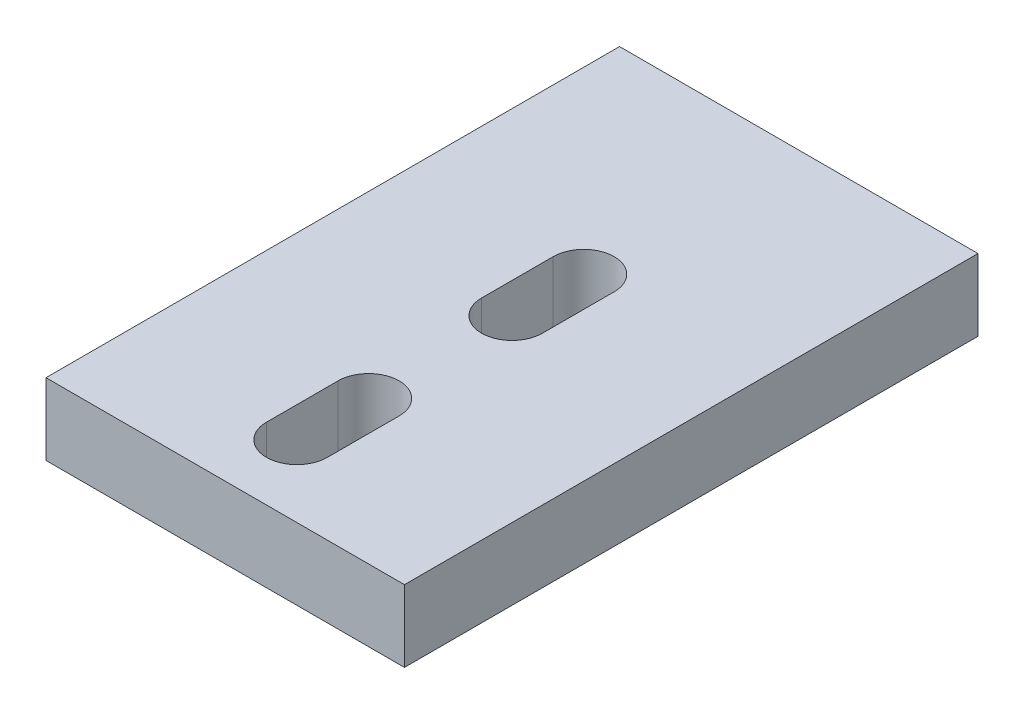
from build123d import *

# Parameters (mm, degrees)
ESQUISSE1_W                = 50
ESQUISSE1_H                = 10
EXTRUSION1_DEPTH           = 40
ENL_V_MAT_EXTRU_1_REACH    = 66.807
R_P_TITION_LIN_AIRE1_COUNT = 2
R_P_TITION_LIN_AIRE1_PITCH = 30


with BuildPart() as part:
    # Esquisse1 → Extrusion1 (new, symmetric)
    with BuildSketch(Plane.XY):
        with Locations((-25, -5)):
            Rectangle(ESQUISSE1_W, ESQUISSE1_H)
    extrude(amount=EXTRUSION1_DEPTH, both=True)

    # Esquisse4 → Enl_v. mat.-Extru.1 (cut, up to next)
    with BuildSketch(Plane(origin=(0, 0, 0), x_dir=(-1, 0, 0), z_dir=(0, 1, 0)), mode=Mode.PRIVATE) as enl_v_mat_extru_1_sk1:
        with BuildLine():
            Line((20.75, 30), (20.75, 20))
            ThreePointArc((20.75, 20), (25, 15.75), (29.25, 20))
            Line((29.25, 20), (29.25, 30))
            ThreePointArc((29.25, 30), (25, 34.25), (20.75, 30))
        make_face()
    enl_v_mat_extru_1_tool1 = extrude(enl_v_mat_extru_1_sk1.sketch, amount=-ENL_V_MAT_EXTRU_1_REACH, mode=Mode.PRIVATE) & part.part
    enl_v_mat_extru_1 = enl_v_mat_extru_1_tool1.solids().sort_by_distance((-25, 0, 25))[0]
    add(enl_v_mat_extru_1, mode=Mode.SUBTRACT)

    # R_p_tition lin_aire1: Enl_v. mat.-Extru.1 ×2
    with Locations(*[(0, 0, -i * R_P_TITION_LIN_AIRE1_PITCH) for i in range(1, R_P_TITION_LIN_AIRE1_COUNT)]):
        add(enl_v_mat_extru_1, mode=Mode.SUBTRACT)


solid = part.part
